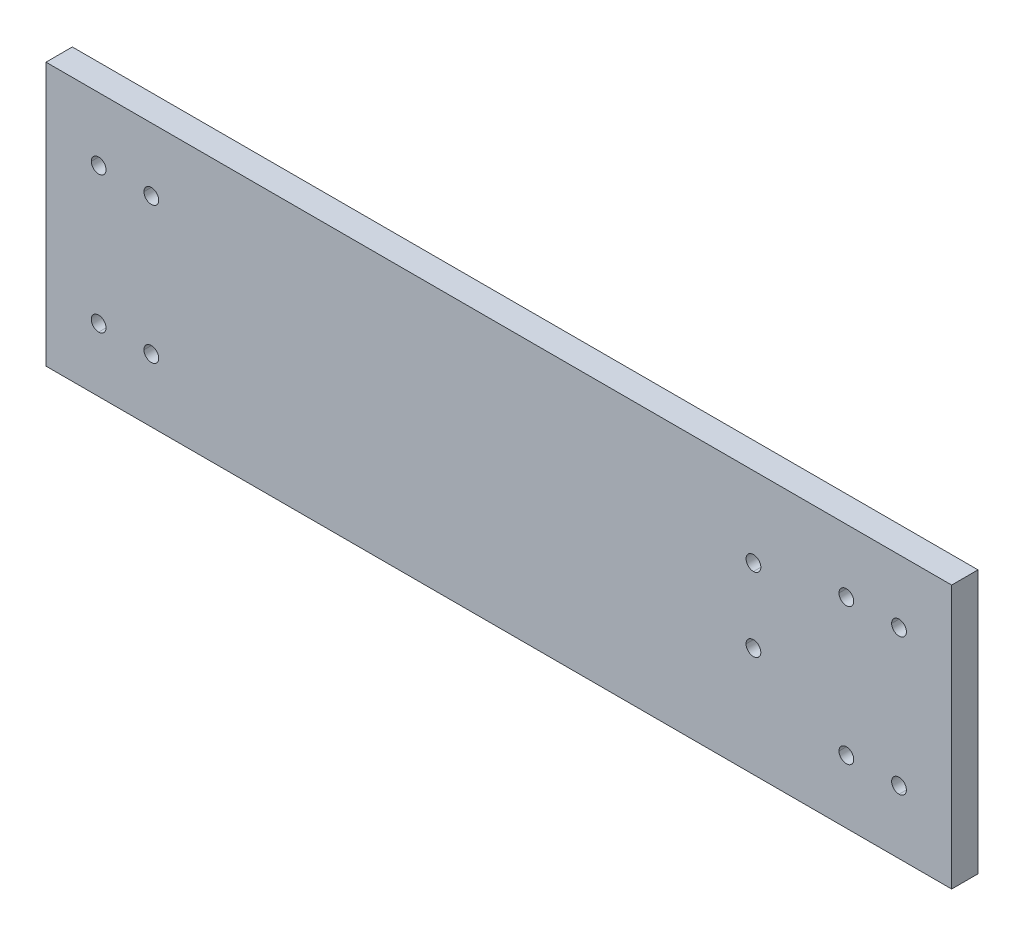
ISO-10303-21;
HEADER;
FILE_DESCRIPTION(('STEP AP214'),'2;1');
FILE_NAME('part.step','',(''),(''),'','','');
FILE_SCHEMA(('AUTOMOTIVE_DESIGN { 1 0 10303 214 1 1 1 1 }'));
ENDSEC;
DATA;
#1=APPLICATION_CONTEXT('core data for automotive mechanical design processes');
#2=APPLICATION_PROTOCOL_DEFINITION('international standard','automotive_design',2000,#1);
#3=PRODUCT_CONTEXT('',#1,'mechanical');
#4=PRODUCT('Part','Part','',(#3));
#5=PRODUCT_RELATED_PRODUCT_CATEGORY('part','',(#4));
#6=PRODUCT_DEFINITION_FORMATION('','',#4);
#7=PRODUCT_DEFINITION_CONTEXT('part definition',#1,'design');
#8=PRODUCT_DEFINITION('design','',#6,#7);
#9=PRODUCT_DEFINITION_SHAPE('','',#8);
#10=(LENGTH_UNIT() NAMED_UNIT(*) SI_UNIT(.MILLI.,.METRE.));
#11=(NAMED_UNIT(*) PLANE_ANGLE_UNIT() SI_UNIT($,.RADIAN.));
#12=(NAMED_UNIT(*) SI_UNIT($,.STERADIAN.) SOLID_ANGLE_UNIT());
#13=UNCERTAINTY_MEASURE_WITH_UNIT(LENGTH_MEASURE(1.E-05),#10,'distance_accuracy_value','');
#14=(GEOMETRIC_REPRESENTATION_CONTEXT(3) GLOBAL_UNCERTAINTY_ASSIGNED_CONTEXT((#13)) GLOBAL_UNIT_ASSIGNED_CONTEXT((#10,
#11,#12)) REPRESENTATION_CONTEXT('',''));
#15=CARTESIAN_POINT('',(0.,0.,0.));
#16=DIRECTION('',(0.,0.,1.));
#17=DIRECTION('',(1.,0.,0.));
#18=AXIS2_PLACEMENT_3D('',#15,#16,#17);
#19=CARTESIAN_POINT('',(-130.005125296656,-4949.99972815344,-456.450170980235));
#20=DIRECTION('',(0.,0.,-1.));
#21=DIRECTION('',(-1.,0.,0.));
#22=AXIS2_PLACEMENT_3D('',#19,#20,#21);
#23=PLANE('',#22);
#24=DIRECTION('',(0.999999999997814,-2.09112819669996E-06,0.));
#25=VECTOR('',#24,1.);
#26=CARTESIAN_POINT('',(729.994351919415,-5200.00152652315,-456.450170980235));
#27=LINE('',#26,#25);
#28=CARTESIAN_POINT('',(-130.005648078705,-5199.9997281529,-456.450170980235));
#29=VERTEX_POINT('',#28);
#30=CARTESIAN_POINT('',(729.994351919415,-5200.00152652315,-456.450170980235));
#31=VERTEX_POINT('',#30);
#32=EDGE_CURVE('E346',#29,#31,#27,.T.);
#33=ORIENTED_EDGE('',*,*,#32,.F.);
#34=DIRECTION('',(-2.09112819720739E-06,-0.999999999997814,0.));
#35=VECTOR('',#34,1.);
#36=CARTESIAN_POINT('',(-130.005648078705,-5199.9997281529,-456.450170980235));
#37=LINE('',#36,#35);
#38=CARTESIAN_POINT('',(-130.005125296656,-4949.99972815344,-456.450170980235));
#39=VERTEX_POINT('',#38);
#40=EDGE_CURVE('E343',#39,#29,#37,.T.);
#41=ORIENTED_EDGE('',*,*,#40,.F.);
#42=DIRECTION('',(-0.999999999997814,2.09112819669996E-06,0.));
#43=VECTOR('',#42,1.);
#44=CARTESIAN_POINT('',(-130.005125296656,-4949.99972815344,-456.450170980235));
#45=LINE('',#44,#43);
#46=CARTESIAN_POINT('',(729.994874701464,-4950.00152652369,-456.450170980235));
#47=VERTEX_POINT('',#46);
#48=EDGE_CURVE('E338',#47,#39,#45,.T.);
#49=ORIENTED_EDGE('',*,*,#48,.F.);
#50=DIRECTION('',(2.09112819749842E-06,0.999999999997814,0.));
#51=VECTOR('',#50,1.);
#52=CARTESIAN_POINT('',(729.994874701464,-4950.00152652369,-456.450170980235));
#53=LINE('',#52,#51);
#54=EDGE_CURVE('E332',#31,#47,#53,.T.);
#55=ORIENTED_EDGE('',*,*,#54,.F.);
#56=EDGE_LOOP('',(#33,#41,#49,#55));
#57=FACE_BOUND('',#56,.T.);
#58=CARTESIAN_POINT('',(541.754997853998,-5026.00053171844,-456.450170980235));
#59=DIRECTION('',(0.,0.,-1.));
#60=DIRECTION('',(-1.,0.,0.));
#61=AXIS2_PLACEMENT_3D('',#58,#59,#60);
#62=CIRCLE('',#61,7.);
#63=CARTESIAN_POINT('',(541.7549832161,-5033.00053171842,-456.450170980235));
#64=VERTEX_POINT('',#63);
#65=CARTESIAN_POINT('',(541.755012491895,-5019.00053171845,-456.450170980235));
#66=VERTEX_POINT('',#65);
#67=EDGE_CURVE('E242',#64,#66,#62,.F.);
#68=ORIENTED_EDGE('',*,*,#67,.T.);
#69=CARTESIAN_POINT('',(541.754997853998,-5026.00053171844,-456.450170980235));
#70=DIRECTION('',(0.,0.,-1.));
#71=DIRECTION('',(-1.,0.,0.));
#72=AXIS2_PLACEMENT_3D('',#69,#70,#71);
#73=CIRCLE('',#72,7.);
#74=EDGE_CURVE('E240',#66,#64,#73,.F.);
#75=ORIENTED_EDGE('',*,*,#74,.T.);
#76=EDGE_LOOP('',(#68,#75));
#77=FACE_BOUND('',#76,.T.);
#78=CARTESIAN_POINT('',(541.754997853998,-5096.00053171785,-456.450170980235));
#79=DIRECTION('',(0.,0.,-1.));
#80=DIRECTION('',(0.,1.,0.));
#81=AXIS2_PLACEMENT_3D('',#78,#79,#80);
#82=CIRCLE('',#81,7.);
#83=CARTESIAN_POINT('',(534.754997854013,-5096.00051707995,-456.450170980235));
#84=VERTEX_POINT('',#83);
#85=CARTESIAN_POINT('',(548.754997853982,-5096.00054635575,-456.450170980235));
#86=VERTEX_POINT('',#85);
#87=EDGE_CURVE('E236',#84,#86,#82,.F.);
#88=ORIENTED_EDGE('',*,*,#87,.T.);
#89=CARTESIAN_POINT('',(541.754997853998,-5096.00053171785,-456.450170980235));
#90=DIRECTION('',(0.,0.,-1.));
#91=DIRECTION('',(0.,1.,0.));
#92=AXIS2_PLACEMENT_3D('',#89,#90,#91);
#93=CIRCLE('',#92,7.);
#94=EDGE_CURVE('E234',#86,#84,#93,.F.);
#95=ORIENTED_EDGE('',*,*,#94,.T.);
#96=EDGE_LOOP('',(#88,#95));
#97=FACE_BOUND('',#96,.T.);
#98=CARTESIAN_POINT('',(-80.0055226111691,-5139.99983270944,-456.450170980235));
#99=DIRECTION('',(0.,0.,-1.));
#100=DIRECTION('',(-1.,0.,0.));
#101=AXIS2_PLACEMENT_3D('',#98,#99,#100);
#102=CIRCLE('',#101,7.);
#103=CARTESIAN_POINT('',(-80.0055079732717,-5132.99983270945,-456.450170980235));
#104=VERTEX_POINT('',#103);
#105=CARTESIAN_POINT('',(-80.0055372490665,-5146.99983270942,-456.450170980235));
#106=VERTEX_POINT('',#105);
#107=EDGE_CURVE('E230',#104,#106,#102,.F.);
#108=ORIENTED_EDGE('',*,*,#107,.T.);
#109=CARTESIAN_POINT('',(-80.0055226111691,-5139.99983270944,-456.450170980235));
#110=DIRECTION('',(0.,0.,-1.));
#111=DIRECTION('',(-1.,0.,0.));
#112=AXIS2_PLACEMENT_3D('',#109,#110,#111);
#113=CIRCLE('',#112,7.);
#114=EDGE_CURVE('E228',#106,#104,#113,.F.);
#115=ORIENTED_EDGE('',*,*,#114,.T.);
#116=EDGE_LOOP('',(#108,#115));
#117=FACE_BOUND('',#116,.T.);
#118=CARTESIAN_POINT('',(-30.005522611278,-5139.99993726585,-456.450170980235));
#119=DIRECTION('',(0.,0.,-1.));
#120=DIRECTION('',(0.,1.,0.));
#121=AXIS2_PLACEMENT_3D('',#118,#119,#120);
#122=CIRCLE('',#121,7.);
#123=CARTESIAN_POINT('',(-37.005522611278,-5139.99993726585,-456.450170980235));
#124=VERTEX_POINT('',#123);
#125=CARTESIAN_POINT('',(-23.005522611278,-5139.99993726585,-456.450170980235));
#126=VERTEX_POINT('',#125);
#127=EDGE_CURVE('E224',#124,#126,#122,.F.);
#128=ORIENTED_EDGE('',*,*,#127,.T.);
#129=CARTESIAN_POINT('',(-30.005522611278,-5139.99993726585,-456.450170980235));
#130=DIRECTION('',(0.,0.,-1.));
#131=DIRECTION('',(0.,1.,0.));
#132=AXIS2_PLACEMENT_3D('',#129,#130,#131);
#133=CIRCLE('',#132,7.);
#134=EDGE_CURVE('E222',#126,#124,#133,.F.);
#135=ORIENTED_EDGE('',*,*,#134,.T.);
#136=EDGE_LOOP('',(#128,#135));
#137=FACE_BOUND('',#136,.T.);
#138=CARTESIAN_POINT('',(-30.0052507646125,-5009.99993726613,-456.450170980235));
#139=DIRECTION('',(0.,0.,-1.));
#140=DIRECTION('',(0.,1.,0.));
#141=AXIS2_PLACEMENT_3D('',#138,#139,#140);
#142=CIRCLE('',#141,7.);
#143=CARTESIAN_POINT('',(-23.0052507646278,-5009.99995190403,-456.450170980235));
#144=VERTEX_POINT('',#143);
#145=CARTESIAN_POINT('',(-37.0052507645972,-5009.99992262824,-456.450170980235));
#146=VERTEX_POINT('',#145);
#147=EDGE_CURVE('E218',#144,#146,#142,.F.);
#148=ORIENTED_EDGE('',*,*,#147,.T.);
#149=CARTESIAN_POINT('',(-30.0052507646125,-5009.99993726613,-456.450170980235));
#150=DIRECTION('',(0.,0.,-1.));
#151=DIRECTION('',(0.,1.,0.));
#152=AXIS2_PLACEMENT_3D('',#149,#150,#151);
#153=CIRCLE('',#152,7.);
#154=EDGE_CURVE('E216',#146,#144,#153,.F.);
#155=ORIENTED_EDGE('',*,*,#154,.T.);
#156=EDGE_LOOP('',(#148,#155));
#157=FACE_BOUND('',#156,.T.);
#158=CARTESIAN_POINT('',(-80.0052507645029,-5009.99983270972,-456.450170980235));
#159=DIRECTION('',(0.,0.,-1.));
#160=DIRECTION('',(0.,1.,0.));
#161=AXIS2_PLACEMENT_3D('',#158,#159,#160);
#162=CIRCLE('',#161,7.);
#163=CARTESIAN_POINT('',(-87.0052507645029,-5009.99983270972,-456.450170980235));
#164=VERTEX_POINT('',#163);
#165=CARTESIAN_POINT('',(-73.0052507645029,-5009.99983270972,-456.450170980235));
#166=VERTEX_POINT('',#165);
#167=EDGE_CURVE('E212',#164,#166,#162,.F.);
#168=ORIENTED_EDGE('',*,*,#167,.T.);
#169=CARTESIAN_POINT('',(-80.0052507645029,-5009.99983270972,-456.450170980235));
#170=DIRECTION('',(0.,0.,-1.));
#171=DIRECTION('',(0.,1.,0.));
#172=AXIS2_PLACEMENT_3D('',#169,#170,#171);
#173=CIRCLE('',#172,7.);
#174=EDGE_CURVE('E210',#166,#164,#173,.F.);
#175=ORIENTED_EDGE('',*,*,#174,.T.);
#176=EDGE_LOOP('',(#168,#175));
#177=FACE_BOUND('',#176,.T.);
#178=CARTESIAN_POINT('',(679.994477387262,-5140.00142196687,-456.450170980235));
#179=DIRECTION('',(0.,0.,-1.));
#180=DIRECTION('',(-1.,0.,0.));
#181=AXIS2_PLACEMENT_3D('',#178,#179,#180);
#182=CIRCLE('',#181,7.);
#183=CARTESIAN_POINT('',(679.994462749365,-5147.00142196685,-456.450170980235));
#184=VERTEX_POINT('',#183);
#185=CARTESIAN_POINT('',(679.99449202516,-5133.00142196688,-456.450170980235));
#186=VERTEX_POINT('',#185);
#187=EDGE_CURVE('E206',#184,#186,#182,.F.);
#188=ORIENTED_EDGE('',*,*,#187,.T.);
#189=CARTESIAN_POINT('',(679.994477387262,-5140.00142196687,-456.450170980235));
#190=DIRECTION('',(0.,0.,-1.));
#191=DIRECTION('',(-1.,0.,0.));
#192=AXIS2_PLACEMENT_3D('',#189,#190,#191);
#193=CIRCLE('',#192,7.);
#194=EDGE_CURVE('E204',#186,#184,#193,.F.);
#195=ORIENTED_EDGE('',*,*,#194,.T.);
#196=EDGE_LOOP('',(#188,#195));
#197=FACE_BOUND('',#196,.T.);
#198=CARTESIAN_POINT('',(629.994477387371,-5140.00131741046,-456.450170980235));
#199=DIRECTION('',(0.,0.,-1.));
#200=DIRECTION('',(0.,1.,0.));
#201=AXIS2_PLACEMENT_3D('',#198,#199,#200);
#202=CIRCLE('',#201,7.);
#203=CARTESIAN_POINT('',(622.994477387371,-5140.00131741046,-456.450170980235));
#204=VERTEX_POINT('',#203);
#205=CARTESIAN_POINT('',(636.994477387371,-5140.00131741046,-456.450170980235));
#206=VERTEX_POINT('',#205);
#207=EDGE_CURVE('E200',#204,#206,#202,.F.);
#208=ORIENTED_EDGE('',*,*,#207,.T.);
#209=CARTESIAN_POINT('',(629.994477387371,-5140.00131741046,-456.450170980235));
#210=DIRECTION('',(0.,0.,-1.));
#211=DIRECTION('',(0.,1.,0.));
#212=AXIS2_PLACEMENT_3D('',#209,#210,#211);
#213=CIRCLE('',#212,7.);
#214=EDGE_CURVE('E198',#206,#204,#213,.F.);
#215=ORIENTED_EDGE('',*,*,#214,.T.);
#216=EDGE_LOOP('',(#208,#215));
#217=FACE_BOUND('',#216,.T.);
#218=CARTESIAN_POINT('',(629.994749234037,-5010.00131741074,-456.450170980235));
#219=DIRECTION('',(0.,0.,-1.));
#220=DIRECTION('',(0.,1.,0.));
#221=AXIS2_PLACEMENT_3D('',#218,#219,#220);
#222=CIRCLE('',#221,7.);
#223=CARTESIAN_POINT('',(636.994749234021,-5010.00133204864,-456.450170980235));
#224=VERTEX_POINT('',#223);
#225=CARTESIAN_POINT('',(622.994749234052,-5010.00130277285,-456.450170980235));
#226=VERTEX_POINT('',#225);
#227=EDGE_CURVE('E195',#224,#226,#222,.F.);
#228=ORIENTED_EDGE('',*,*,#227,.T.);
#229=CARTESIAN_POINT('',(629.994749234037,-5010.00131741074,-456.450170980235));
#230=DIRECTION('',(0.,0.,-1.));
#231=DIRECTION('',(0.,1.,0.));
#232=AXIS2_PLACEMENT_3D('',#229,#230,#231);
#233=CIRCLE('',#232,7.);
#234=EDGE_CURVE('E188',#226,#224,#233,.F.);
#235=ORIENTED_EDGE('',*,*,#234,.T.);
#236=EDGE_LOOP('',(#228,#235));
#237=FACE_BOUND('',#236,.T.);
#238=CARTESIAN_POINT('',(679.994749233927,-5010.00142196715,-456.450170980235));
#239=DIRECTION('',(0.,0.,-1.));
#240=DIRECTION('',(0.,1.,0.));
#241=AXIS2_PLACEMENT_3D('',#238,#239,#240);
#242=CIRCLE('',#241,7.);
#243=CARTESIAN_POINT('',(672.994749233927,-5010.00142196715,-456.450170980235));
#244=VERTEX_POINT('',#243);
#245=CARTESIAN_POINT('',(686.994749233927,-5010.00142196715,-456.450170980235));
#246=VERTEX_POINT('',#245);
#247=EDGE_CURVE('E175',#244,#246,#242,.F.);
#248=ORIENTED_EDGE('',*,*,#247,.T.);
#249=CARTESIAN_POINT('',(679.994749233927,-5010.00142196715,-456.450170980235));
#250=DIRECTION('',(0.,0.,-1.));
#251=DIRECTION('',(0.,1.,0.));
#252=AXIS2_PLACEMENT_3D('',#249,#250,#251);
#253=CIRCLE('',#252,7.);
#254=EDGE_CURVE('E20',#246,#244,#253,.F.);
#255=ORIENTED_EDGE('',*,*,#254,.T.);
#256=EDGE_LOOP('',(#248,#255));
#257=FACE_BOUND('',#256,.T.);
#258=ADVANCED_FACE('F17',(#57,#77,#97,#117,#137,#157,#177,#197,#217,#237,#257),#23,.T.);
#259=CARTESIAN_POINT('',(679.994749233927,-5010.00142196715,-443.950170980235));
#260=DIRECTION('',(0.,0.,-1.));
#261=DIRECTION('',(0.,1.,0.));
#262=AXIS2_PLACEMENT_3D('',#259,#260,#261);
#263=CYLINDRICAL_SURFACE('',#262,7.);
#264=ORIENTED_EDGE('',*,*,#254,.F.);
#265=DIRECTION('',(0.,0.,-1.));
#266=VECTOR('',#265,1.);
#267=CARTESIAN_POINT('',(686.994749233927,-5010.00142196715,-443.950170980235));
#268=LINE('',#267,#266);
#269=CARTESIAN_POINT('',(686.994749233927,-5010.00142196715,-431.450170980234));
#270=VERTEX_POINT('',#269);
#271=EDGE_CURVE('E189',#246,#270,#268,.F.);
#272=ORIENTED_EDGE('',*,*,#271,.T.);
#273=CARTESIAN_POINT('',(679.994749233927,-5010.00142196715,-431.450170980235));
#274=DIRECTION('',(0.,0.,-1.));
#275=DIRECTION('',(0.,1.,0.));
#276=AXIS2_PLACEMENT_3D('',#273,#274,#275);
#277=CIRCLE('',#276,7.);
#278=CARTESIAN_POINT('',(672.994749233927,-5010.00142196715,-431.450170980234));
#279=VERTEX_POINT('',#278);
#280=EDGE_CURVE('E184',#279,#270,#277,.T.);
#281=ORIENTED_EDGE('',*,*,#280,.F.);
#282=DIRECTION('',(0.,0.,-1.));
#283=VECTOR('',#282,1.);
#284=CARTESIAN_POINT('',(672.994749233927,-5010.00142196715,-443.950170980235));
#285=LINE('',#284,#283);
#286=EDGE_CURVE('E181',#279,#244,#285,.T.);
#287=ORIENTED_EDGE('',*,*,#286,.T.);
#288=EDGE_LOOP('',(#264,#272,#281,#287));
#289=FACE_BOUND('',#288,.T.);
#290=ADVANCED_FACE('F182',(#289),#263,.F.);
#291=CARTESIAN_POINT('',(679.994749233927,-5010.00142196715,-443.950170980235));
#292=DIRECTION('',(0.,0.,-1.));
#293=DIRECTION('',(0.,1.,0.));
#294=AXIS2_PLACEMENT_3D('',#291,#292,#293);
#295=CYLINDRICAL_SURFACE('',#294,7.);
#296=CARTESIAN_POINT('',(679.994749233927,-5010.00142196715,-431.450170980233));
#297=DIRECTION('',(0.,0.,-1.));
#298=DIRECTION('',(0.,1.,0.));
#299=AXIS2_PLACEMENT_3D('',#296,#297,#298);
#300=CIRCLE('',#299,7.);
#301=EDGE_CURVE('E247',#270,#279,#300,.T.);
#302=ORIENTED_EDGE('',*,*,#301,.F.);
#303=ORIENTED_EDGE('',*,*,#271,.F.);
#304=ORIENTED_EDGE('',*,*,#247,.F.);
#305=ORIENTED_EDGE('',*,*,#286,.F.);
#306=EDGE_LOOP('',(#302,#303,#304,#305));
#307=FACE_BOUND('',#306,.T.);
#308=ADVANCED_FACE('F191',(#307),#295,.F.);
#309=CARTESIAN_POINT('',(629.994749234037,-5010.00131741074,-443.950170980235));
#310=DIRECTION('',(0.,0.,-1.));
#311=DIRECTION('',(0.,1.,0.));
#312=AXIS2_PLACEMENT_3D('',#309,#310,#311);
#313=CYLINDRICAL_SURFACE('',#312,7.);
#314=ORIENTED_EDGE('',*,*,#234,.F.);
#315=DIRECTION('',(0.,0.,-1.));
#316=VECTOR('',#315,1.);
#317=CARTESIAN_POINT('',(622.994749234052,-5010.00130277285,-443.950170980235));
#318=LINE('',#317,#316);
#319=CARTESIAN_POINT('',(622.994749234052,-5010.00130277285,-431.450170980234));
#320=VERTEX_POINT('',#319);
#321=EDGE_CURVE('E197',#226,#320,#318,.F.);
#322=ORIENTED_EDGE('',*,*,#321,.T.);
#323=CARTESIAN_POINT('',(629.994749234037,-5010.00131741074,-431.450170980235));
#324=DIRECTION('',(0.,0.,-1.));
#325=DIRECTION('',(0.,1.,0.));
#326=AXIS2_PLACEMENT_3D('',#323,#324,#325);
#327=CIRCLE('',#326,7.);
#328=CARTESIAN_POINT('',(636.994749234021,-5010.00133204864,-431.450170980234));
#329=VERTEX_POINT('',#328);
#330=EDGE_CURVE('E250',#329,#320,#327,.T.);
#331=ORIENTED_EDGE('',*,*,#330,.F.);
#332=DIRECTION('',(0.,0.,-1.));
#333=VECTOR('',#332,1.);
#334=CARTESIAN_POINT('',(636.994749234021,-5010.00133204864,-443.950170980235));
#335=LINE('',#334,#333);
#336=EDGE_CURVE('E201',#329,#224,#335,.T.);
#337=ORIENTED_EDGE('',*,*,#336,.T.);
#338=EDGE_LOOP('',(#314,#322,#331,#337));
#339=FACE_BOUND('',#338,.T.);
#340=ADVANCED_FACE('F544',(#339),#313,.F.);
#341=CARTESIAN_POINT('',(629.994749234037,-5010.00131741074,-443.950170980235));
#342=DIRECTION('',(0.,0.,-1.));
#343=DIRECTION('',(0.,1.,0.));
#344=AXIS2_PLACEMENT_3D('',#341,#342,#343);
#345=CYLINDRICAL_SURFACE('',#344,7.);
#346=CARTESIAN_POINT('',(629.994749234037,-5010.00131741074,-431.450170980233));
#347=DIRECTION('',(0.,0.,-1.));
#348=DIRECTION('',(0.,1.,0.));
#349=AXIS2_PLACEMENT_3D('',#346,#347,#348);
#350=CIRCLE('',#349,7.);
#351=EDGE_CURVE('E253',#320,#329,#350,.T.);
#352=ORIENTED_EDGE('',*,*,#351,.F.);
#353=ORIENTED_EDGE('',*,*,#321,.F.);
#354=ORIENTED_EDGE('',*,*,#227,.F.);
#355=ORIENTED_EDGE('',*,*,#336,.F.);
#356=EDGE_LOOP('',(#352,#353,#354,#355));
#357=FACE_BOUND('',#356,.T.);
#358=ADVANCED_FACE('F536',(#357),#345,.F.);
#359=CARTESIAN_POINT('',(629.994477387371,-5140.00131741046,-443.950170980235));
#360=DIRECTION('',(0.,0.,-1.));
#361=DIRECTION('',(0.,1.,0.));
#362=AXIS2_PLACEMENT_3D('',#359,#360,#361);
#363=CYLINDRICAL_SURFACE('',#362,7.);
#364=ORIENTED_EDGE('',*,*,#214,.F.);
#365=DIRECTION('',(0.,0.,-1.));
#366=VECTOR('',#365,1.);
#367=CARTESIAN_POINT('',(636.994477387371,-5140.00131741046,-443.950170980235));
#368=LINE('',#367,#366);
#369=CARTESIAN_POINT('',(636.994477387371,-5140.00131741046,-431.450170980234));
#370=VERTEX_POINT('',#369);
#371=EDGE_CURVE('E203',#206,#370,#368,.F.);
#372=ORIENTED_EDGE('',*,*,#371,.T.);
#373=CARTESIAN_POINT('',(629.994477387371,-5140.00131741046,-431.450170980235));
#374=DIRECTION('',(0.,0.,-1.));
#375=DIRECTION('',(0.,1.,0.));
#376=AXIS2_PLACEMENT_3D('',#373,#374,#375);
#377=CIRCLE('',#376,7.);
#378=CARTESIAN_POINT('',(622.994477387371,-5140.00131741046,-431.450170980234));
#379=VERTEX_POINT('',#378);
#380=EDGE_CURVE('E256',#379,#370,#377,.T.);
#381=ORIENTED_EDGE('',*,*,#380,.F.);
#382=DIRECTION('',(0.,0.,-1.));
#383=VECTOR('',#382,1.);
#384=CARTESIAN_POINT('',(622.994477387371,-5140.00131741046,-443.950170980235));
#385=LINE('',#384,#383);
#386=EDGE_CURVE('E207',#379,#204,#385,.T.);
#387=ORIENTED_EDGE('',*,*,#386,.T.);
#388=EDGE_LOOP('',(#364,#372,#381,#387));
#389=FACE_BOUND('',#388,.T.);
#390=ADVANCED_FACE('F528',(#389),#363,.F.);
#391=CARTESIAN_POINT('',(629.994477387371,-5140.00131741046,-443.950170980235));
#392=DIRECTION('',(0.,0.,-1.));
#393=DIRECTION('',(0.,1.,0.));
#394=AXIS2_PLACEMENT_3D('',#391,#392,#393);
#395=CYLINDRICAL_SURFACE('',#394,7.);
#396=CARTESIAN_POINT('',(629.994477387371,-5140.00131741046,-431.450170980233));
#397=DIRECTION('',(0.,0.,-1.));
#398=DIRECTION('',(0.,1.,0.));
#399=AXIS2_PLACEMENT_3D('',#396,#397,#398);
#400=CIRCLE('',#399,7.);
#401=EDGE_CURVE('E259',#370,#379,#400,.T.);
#402=ORIENTED_EDGE('',*,*,#401,.F.);
#403=ORIENTED_EDGE('',*,*,#371,.F.);
#404=ORIENTED_EDGE('',*,*,#207,.F.);
#405=ORIENTED_EDGE('',*,*,#386,.F.);
#406=EDGE_LOOP('',(#402,#403,#404,#405));
#407=FACE_BOUND('',#406,.T.);
#408=ADVANCED_FACE('F520',(#407),#395,.F.);
#409=CARTESIAN_POINT('',(679.994477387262,-5140.00142196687,-443.950170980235));
#410=DIRECTION('',(0.,0.,-1.));
#411=DIRECTION('',(-1.,0.,0.));
#412=AXIS2_PLACEMENT_3D('',#409,#410,#411);
#413=CYLINDRICAL_SURFACE('',#412,7.);
#414=ORIENTED_EDGE('',*,*,#194,.F.);
#415=DIRECTION('',(0.,0.,-1.));
#416=VECTOR('',#415,1.);
#417=CARTESIAN_POINT('',(679.99449202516,-5133.00142196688,-443.950170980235));
#418=LINE('',#417,#416);
#419=CARTESIAN_POINT('',(679.99449202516,-5133.00142196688,-431.450170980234));
#420=VERTEX_POINT('',#419);
#421=EDGE_CURVE('E209',#186,#420,#418,.F.);
#422=ORIENTED_EDGE('',*,*,#421,.T.);
#423=CARTESIAN_POINT('',(679.994477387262,-5140.00142196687,-431.450170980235));
#424=DIRECTION('',(0.,0.,-1.));
#425=DIRECTION('',(-1.,0.,0.));
#426=AXIS2_PLACEMENT_3D('',#423,#424,#425);
#427=CIRCLE('',#426,7.);
#428=CARTESIAN_POINT('',(679.994462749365,-5147.00142196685,-431.450170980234));
#429=VERTEX_POINT('',#428);
#430=EDGE_CURVE('E262',#429,#420,#427,.T.);
#431=ORIENTED_EDGE('',*,*,#430,.F.);
#432=DIRECTION('',(0.,0.,-1.));
#433=VECTOR('',#432,1.);
#434=CARTESIAN_POINT('',(679.994462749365,-5147.00142196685,-443.950170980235));
#435=LINE('',#434,#433);
#436=EDGE_CURVE('E213',#429,#184,#435,.T.);
#437=ORIENTED_EDGE('',*,*,#436,.T.);
#438=EDGE_LOOP('',(#414,#422,#431,#437));
#439=FACE_BOUND('',#438,.T.);
#440=ADVANCED_FACE('F512',(#439),#413,.F.);
#441=CARTESIAN_POINT('',(679.994477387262,-5140.00142196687,-443.950170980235));
#442=DIRECTION('',(0.,0.,-1.));
#443=DIRECTION('',(-1.,0.,0.));
#444=AXIS2_PLACEMENT_3D('',#441,#442,#443);
#445=CYLINDRICAL_SURFACE('',#444,7.);
#446=CARTESIAN_POINT('',(679.994477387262,-5140.00142196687,-431.450170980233));
#447=DIRECTION('',(0.,0.,-1.));
#448=DIRECTION('',(-1.,0.,0.));
#449=AXIS2_PLACEMENT_3D('',#446,#447,#448);
#450=CIRCLE('',#449,7.);
#451=EDGE_CURVE('E265',#420,#429,#450,.T.);
#452=ORIENTED_EDGE('',*,*,#451,.F.);
#453=ORIENTED_EDGE('',*,*,#421,.F.);
#454=ORIENTED_EDGE('',*,*,#187,.F.);
#455=ORIENTED_EDGE('',*,*,#436,.F.);
#456=EDGE_LOOP('',(#452,#453,#454,#455));
#457=FACE_BOUND('',#456,.T.);
#458=ADVANCED_FACE('F504',(#457),#445,.F.);
#459=CARTESIAN_POINT('',(-80.0052507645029,-5009.99983270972,-443.950170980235));
#460=DIRECTION('',(0.,0.,-1.));
#461=DIRECTION('',(0.,1.,0.));
#462=AXIS2_PLACEMENT_3D('',#459,#460,#461);
#463=CYLINDRICAL_SURFACE('',#462,7.);
#464=ORIENTED_EDGE('',*,*,#174,.F.);
#465=DIRECTION('',(0.,0.,-1.));
#466=VECTOR('',#465,1.);
#467=CARTESIAN_POINT('',(-73.0052507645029,-5009.99983270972,-443.950170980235));
#468=LINE('',#467,#466);
#469=CARTESIAN_POINT('',(-73.0052507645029,-5009.99983270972,-431.450170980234));
#470=VERTEX_POINT('',#469);
#471=EDGE_CURVE('E215',#166,#470,#468,.F.);
#472=ORIENTED_EDGE('',*,*,#471,.T.);
#473=CARTESIAN_POINT('',(-80.0052507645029,-5009.99983270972,-431.450170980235));
#474=DIRECTION('',(0.,0.,-1.));
#475=DIRECTION('',(0.,1.,0.));
#476=AXIS2_PLACEMENT_3D('',#473,#474,#475);
#477=CIRCLE('',#476,7.);
#478=CARTESIAN_POINT('',(-87.0052507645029,-5009.99983270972,-431.450170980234));
#479=VERTEX_POINT('',#478);
#480=EDGE_CURVE('E268',#479,#470,#477,.T.);
#481=ORIENTED_EDGE('',*,*,#480,.F.);
#482=DIRECTION('',(0.,0.,-1.));
#483=VECTOR('',#482,1.);
#484=CARTESIAN_POINT('',(-87.0052507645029,-5009.99983270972,-443.950170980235));
#485=LINE('',#484,#483);
#486=EDGE_CURVE('E219',#479,#164,#485,.T.);
#487=ORIENTED_EDGE('',*,*,#486,.T.);
#488=EDGE_LOOP('',(#464,#472,#481,#487));
#489=FACE_BOUND('',#488,.T.);
#490=ADVANCED_FACE('F496',(#489),#463,.F.);
#491=CARTESIAN_POINT('',(-80.0052507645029,-5009.99983270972,-443.950170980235));
#492=DIRECTION('',(0.,0.,-1.));
#493=DIRECTION('',(0.,1.,0.));
#494=AXIS2_PLACEMENT_3D('',#491,#492,#493);
#495=CYLINDRICAL_SURFACE('',#494,7.);
#496=CARTESIAN_POINT('',(-80.0052507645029,-5009.99983270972,-431.450170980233));
#497=DIRECTION('',(0.,0.,-1.));
#498=DIRECTION('',(0.,1.,0.));
#499=AXIS2_PLACEMENT_3D('',#496,#497,#498);
#500=CIRCLE('',#499,7.);
#501=EDGE_CURVE('E271',#470,#479,#500,.T.);
#502=ORIENTED_EDGE('',*,*,#501,.F.);
#503=ORIENTED_EDGE('',*,*,#471,.F.);
#504=ORIENTED_EDGE('',*,*,#167,.F.);
#505=ORIENTED_EDGE('',*,*,#486,.F.);
#506=EDGE_LOOP('',(#502,#503,#504,#505));
#507=FACE_BOUND('',#506,.T.);
#508=ADVANCED_FACE('F488',(#507),#495,.F.);
#509=CARTESIAN_POINT('',(-30.0052507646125,-5009.99993726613,-443.950170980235));
#510=DIRECTION('',(0.,0.,-1.));
#511=DIRECTION('',(0.,1.,0.));
#512=AXIS2_PLACEMENT_3D('',#509,#510,#511);
#513=CYLINDRICAL_SURFACE('',#512,7.);
#514=ORIENTED_EDGE('',*,*,#154,.F.);
#515=DIRECTION('',(0.,0.,-1.));
#516=VECTOR('',#515,1.);
#517=CARTESIAN_POINT('',(-37.0052507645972,-5009.99992262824,-443.950170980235));
#518=LINE('',#517,#516);
#519=CARTESIAN_POINT('',(-37.0052507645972,-5009.99992262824,-431.450170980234));
#520=VERTEX_POINT('',#519);
#521=EDGE_CURVE('E221',#146,#520,#518,.F.);
#522=ORIENTED_EDGE('',*,*,#521,.T.);
#523=CARTESIAN_POINT('',(-30.0052507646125,-5009.99993726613,-431.450170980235));
#524=DIRECTION('',(0.,0.,-1.));
#525=DIRECTION('',(0.,1.,0.));
#526=AXIS2_PLACEMENT_3D('',#523,#524,#525);
#527=CIRCLE('',#526,7.);
#528=CARTESIAN_POINT('',(-23.0052507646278,-5009.99995190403,-431.450170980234));
#529=VERTEX_POINT('',#528);
#530=EDGE_CURVE('E274',#529,#520,#527,.T.);
#531=ORIENTED_EDGE('',*,*,#530,.F.);
#532=DIRECTION('',(0.,0.,-1.));
#533=VECTOR('',#532,1.);
#534=CARTESIAN_POINT('',(-23.0052507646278,-5009.99995190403,-443.950170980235));
#535=LINE('',#534,#533);
#536=EDGE_CURVE('E225',#529,#144,#535,.T.);
#537=ORIENTED_EDGE('',*,*,#536,.T.);
#538=EDGE_LOOP('',(#514,#522,#531,#537));
#539=FACE_BOUND('',#538,.T.);
#540=ADVANCED_FACE('F480',(#539),#513,.F.);
#541=CARTESIAN_POINT('',(-30.0052507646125,-5009.99993726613,-443.950170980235));
#542=DIRECTION('',(0.,0.,-1.));
#543=DIRECTION('',(0.,1.,0.));
#544=AXIS2_PLACEMENT_3D('',#541,#542,#543);
#545=CYLINDRICAL_SURFACE('',#544,7.);
#546=CARTESIAN_POINT('',(-30.0052507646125,-5009.99993726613,-431.450170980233));
#547=DIRECTION('',(0.,0.,-1.));
#548=DIRECTION('',(0.,1.,0.));
#549=AXIS2_PLACEMENT_3D('',#546,#547,#548);
#550=CIRCLE('',#549,7.);
#551=EDGE_CURVE('E277',#520,#529,#550,.T.);
#552=ORIENTED_EDGE('',*,*,#551,.F.);
#553=ORIENTED_EDGE('',*,*,#521,.F.);
#554=ORIENTED_EDGE('',*,*,#147,.F.);
#555=ORIENTED_EDGE('',*,*,#536,.F.);
#556=EDGE_LOOP('',(#552,#553,#554,#555));
#557=FACE_BOUND('',#556,.T.);
#558=ADVANCED_FACE('F472',(#557),#545,.F.);
#559=CARTESIAN_POINT('',(-30.005522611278,-5139.99993726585,-443.950170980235));
#560=DIRECTION('',(0.,0.,-1.));
#561=DIRECTION('',(0.,1.,0.));
#562=AXIS2_PLACEMENT_3D('',#559,#560,#561);
#563=CYLINDRICAL_SURFACE('',#562,7.);
#564=ORIENTED_EDGE('',*,*,#134,.F.);
#565=DIRECTION('',(0.,0.,-1.));
#566=VECTOR('',#565,1.);
#567=CARTESIAN_POINT('',(-23.005522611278,-5139.99993726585,-443.950170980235));
#568=LINE('',#567,#566);
#569=CARTESIAN_POINT('',(-23.005522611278,-5139.99993726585,-431.450170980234));
#570=VERTEX_POINT('',#569);
#571=EDGE_CURVE('E227',#126,#570,#568,.F.);
#572=ORIENTED_EDGE('',*,*,#571,.T.);
#573=CARTESIAN_POINT('',(-30.005522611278,-5139.99993726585,-431.450170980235));
#574=DIRECTION('',(0.,0.,-1.));
#575=DIRECTION('',(0.,1.,0.));
#576=AXIS2_PLACEMENT_3D('',#573,#574,#575);
#577=CIRCLE('',#576,7.);
#578=CARTESIAN_POINT('',(-37.005522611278,-5139.99993726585,-431.450170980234));
#579=VERTEX_POINT('',#578);
#580=EDGE_CURVE('E280',#579,#570,#577,.T.);
#581=ORIENTED_EDGE('',*,*,#580,.F.);
#582=DIRECTION('',(0.,0.,-1.));
#583=VECTOR('',#582,1.);
#584=CARTESIAN_POINT('',(-37.005522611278,-5139.99993726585,-443.950170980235));
#585=LINE('',#584,#583);
#586=EDGE_CURVE('E231',#579,#124,#585,.T.);
#587=ORIENTED_EDGE('',*,*,#586,.T.);
#588=EDGE_LOOP('',(#564,#572,#581,#587));
#589=FACE_BOUND('',#588,.T.);
#590=ADVANCED_FACE('F464',(#589),#563,.F.);
#591=CARTESIAN_POINT('',(-30.005522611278,-5139.99993726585,-443.950170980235));
#592=DIRECTION('',(0.,0.,-1.));
#593=DIRECTION('',(0.,1.,0.));
#594=AXIS2_PLACEMENT_3D('',#591,#592,#593);
#595=CYLINDRICAL_SURFACE('',#594,7.);
#596=CARTESIAN_POINT('',(-30.005522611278,-5139.99993726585,-431.450170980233));
#597=DIRECTION('',(0.,0.,-1.));
#598=DIRECTION('',(0.,1.,0.));
#599=AXIS2_PLACEMENT_3D('',#596,#597,#598);
#600=CIRCLE('',#599,7.);
#601=EDGE_CURVE('E283',#570,#579,#600,.T.);
#602=ORIENTED_EDGE('',*,*,#601,.F.);
#603=ORIENTED_EDGE('',*,*,#571,.F.);
#604=ORIENTED_EDGE('',*,*,#127,.F.);
#605=ORIENTED_EDGE('',*,*,#586,.F.);
#606=EDGE_LOOP('',(#602,#603,#604,#605));
#607=FACE_BOUND('',#606,.T.);
#608=ADVANCED_FACE('F456',(#607),#595,.F.);
#609=CARTESIAN_POINT('',(-80.0055226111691,-5139.99983270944,-443.950170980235));
#610=DIRECTION('',(0.,0.,-1.));
#611=DIRECTION('',(-1.,0.,0.));
#612=AXIS2_PLACEMENT_3D('',#609,#610,#611);
#613=CYLINDRICAL_SURFACE('',#612,7.);
#614=ORIENTED_EDGE('',*,*,#114,.F.);
#615=DIRECTION('',(0.,0.,-1.));
#616=VECTOR('',#615,1.);
#617=CARTESIAN_POINT('',(-80.0055372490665,-5146.99983270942,-443.950170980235));
#618=LINE('',#617,#616);
#619=CARTESIAN_POINT('',(-80.0055372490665,-5146.99983270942,-431.450170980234));
#620=VERTEX_POINT('',#619);
#621=EDGE_CURVE('E233',#106,#620,#618,.F.);
#622=ORIENTED_EDGE('',*,*,#621,.T.);
#623=CARTESIAN_POINT('',(-80.0055226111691,-5139.99983270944,-431.450170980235));
#624=DIRECTION('',(0.,0.,-1.));
#625=DIRECTION('',(-1.,0.,0.));
#626=AXIS2_PLACEMENT_3D('',#623,#624,#625);
#627=CIRCLE('',#626,7.);
#628=CARTESIAN_POINT('',(-80.0055079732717,-5132.99983270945,-431.450170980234));
#629=VERTEX_POINT('',#628);
#630=EDGE_CURVE('E286',#629,#620,#627,.T.);
#631=ORIENTED_EDGE('',*,*,#630,.F.);
#632=DIRECTION('',(0.,0.,-1.));
#633=VECTOR('',#632,1.);
#634=CARTESIAN_POINT('',(-80.0055079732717,-5132.99983270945,-443.950170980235));
#635=LINE('',#634,#633);
#636=EDGE_CURVE('E237',#629,#104,#635,.T.);
#637=ORIENTED_EDGE('',*,*,#636,.T.);
#638=EDGE_LOOP('',(#614,#622,#631,#637));
#639=FACE_BOUND('',#638,.T.);
#640=ADVANCED_FACE('F448',(#639),#613,.F.);
#641=CARTESIAN_POINT('',(-80.0055226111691,-5139.99983270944,-443.950170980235));
#642=DIRECTION('',(0.,0.,-1.));
#643=DIRECTION('',(-1.,0.,0.));
#644=AXIS2_PLACEMENT_3D('',#641,#642,#643);
#645=CYLINDRICAL_SURFACE('',#644,7.);
#646=CARTESIAN_POINT('',(-80.0055226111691,-5139.99983270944,-431.450170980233));
#647=DIRECTION('',(0.,0.,-1.));
#648=DIRECTION('',(-1.,0.,0.));
#649=AXIS2_PLACEMENT_3D('',#646,#647,#648);
#650=CIRCLE('',#649,7.);
#651=EDGE_CURVE('E289',#620,#629,#650,.T.);
#652=ORIENTED_EDGE('',*,*,#651,.F.);
#653=ORIENTED_EDGE('',*,*,#621,.F.);
#654=ORIENTED_EDGE('',*,*,#107,.F.);
#655=ORIENTED_EDGE('',*,*,#636,.F.);
#656=EDGE_LOOP('',(#652,#653,#654,#655));
#657=FACE_BOUND('',#656,.T.);
#658=ADVANCED_FACE('F440',(#657),#645,.F.);
#659=CARTESIAN_POINT('',(541.754997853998,-5096.00053171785,-443.950170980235));
#660=DIRECTION('',(0.,0.,-1.));
#661=DIRECTION('',(0.,1.,0.));
#662=AXIS2_PLACEMENT_3D('',#659,#660,#661);
#663=CYLINDRICAL_SURFACE('',#662,7.);
#664=ORIENTED_EDGE('',*,*,#94,.F.);
#665=DIRECTION('',(0.,0.,-1.));
#666=VECTOR('',#665,1.);
#667=CARTESIAN_POINT('',(548.754997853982,-5096.00054635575,-443.950170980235));
#668=LINE('',#667,#666);
#669=CARTESIAN_POINT('',(548.754997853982,-5096.00054635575,-431.450170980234));
#670=VERTEX_POINT('',#669);
#671=EDGE_CURVE('E239',#86,#670,#668,.F.);
#672=ORIENTED_EDGE('',*,*,#671,.T.);
#673=CARTESIAN_POINT('',(541.754997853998,-5096.00053171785,-431.450170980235));
#674=DIRECTION('',(0.,0.,-1.));
#675=DIRECTION('',(0.,1.,0.));
#676=AXIS2_PLACEMENT_3D('',#673,#674,#675);
#677=CIRCLE('',#676,7.);
#678=CARTESIAN_POINT('',(534.754997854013,-5096.00051707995,-431.450170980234));
#679=VERTEX_POINT('',#678);
#680=EDGE_CURVE('E292',#679,#670,#677,.T.);
#681=ORIENTED_EDGE('',*,*,#680,.F.);
#682=DIRECTION('',(0.,0.,-1.));
#683=VECTOR('',#682,1.);
#684=CARTESIAN_POINT('',(534.754997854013,-5096.00051707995,-443.950170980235));
#685=LINE('',#684,#683);
#686=EDGE_CURVE('E243',#679,#84,#685,.T.);
#687=ORIENTED_EDGE('',*,*,#686,.T.);
#688=EDGE_LOOP('',(#664,#672,#681,#687));
#689=FACE_BOUND('',#688,.T.);
#690=ADVANCED_FACE('F432',(#689),#663,.F.);
#691=CARTESIAN_POINT('',(541.754997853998,-5096.00053171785,-443.950170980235));
#692=DIRECTION('',(0.,0.,-1.));
#693=DIRECTION('',(0.,1.,0.));
#694=AXIS2_PLACEMENT_3D('',#691,#692,#693);
#695=CYLINDRICAL_SURFACE('',#694,7.);
#696=CARTESIAN_POINT('',(541.754997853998,-5096.00053171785,-431.450170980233));
#697=DIRECTION('',(0.,0.,-1.));
#698=DIRECTION('',(0.,1.,0.));
#699=AXIS2_PLACEMENT_3D('',#696,#697,#698);
#700=CIRCLE('',#699,7.);
#701=EDGE_CURVE('E295',#670,#679,#700,.T.);
#702=ORIENTED_EDGE('',*,*,#701,.F.);
#703=ORIENTED_EDGE('',*,*,#671,.F.);
#704=ORIENTED_EDGE('',*,*,#87,.F.);
#705=ORIENTED_EDGE('',*,*,#686,.F.);
#706=EDGE_LOOP('',(#702,#703,#704,#705));
#707=FACE_BOUND('',#706,.T.);
#708=ADVANCED_FACE('F424',(#707),#695,.F.);
#709=CARTESIAN_POINT('',(541.754997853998,-5026.00053171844,-443.950170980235));
#710=DIRECTION('',(0.,0.,-1.));
#711=DIRECTION('',(-1.,0.,0.));
#712=AXIS2_PLACEMENT_3D('',#709,#710,#711);
#713=CYLINDRICAL_SURFACE('',#712,7.);
#714=ORIENTED_EDGE('',*,*,#74,.F.);
#715=DIRECTION('',(0.,0.,-1.));
#716=VECTOR('',#715,1.);
#717=CARTESIAN_POINT('',(541.755012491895,-5019.00053171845,-443.950170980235));
#718=LINE('',#717,#716);
#719=CARTESIAN_POINT('',(541.755012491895,-5019.00053171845,-431.450170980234));
#720=VERTEX_POINT('',#719);
#721=EDGE_CURVE('E245',#66,#720,#718,.F.);
#722=ORIENTED_EDGE('',*,*,#721,.T.);
#723=CARTESIAN_POINT('',(541.754997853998,-5026.00053171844,-431.450170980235));
#724=DIRECTION('',(0.,0.,-1.));
#725=DIRECTION('',(-1.,0.,0.));
#726=AXIS2_PLACEMENT_3D('',#723,#724,#725);
#727=CIRCLE('',#726,7.);
#728=CARTESIAN_POINT('',(541.7549832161,-5033.00053171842,-431.450170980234));
#729=VERTEX_POINT('',#728);
#730=EDGE_CURVE('E298',#729,#720,#727,.T.);
#731=ORIENTED_EDGE('',*,*,#730,.F.);
#732=DIRECTION('',(0.,0.,-1.));
#733=VECTOR('',#732,1.);
#734=CARTESIAN_POINT('',(541.7549832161,-5033.00053171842,-443.950170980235));
#735=LINE('',#734,#733);
#736=EDGE_CURVE('E329',#729,#64,#735,.T.);
#737=ORIENTED_EDGE('',*,*,#736,.T.);
#738=EDGE_LOOP('',(#714,#722,#731,#737));
#739=FACE_BOUND('',#738,.T.);
#740=ADVANCED_FACE('F383',(#739),#713,.F.);
#741=CARTESIAN_POINT('',(541.754997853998,-5026.00053171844,-443.950170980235));
#742=DIRECTION('',(0.,0.,-1.));
#743=DIRECTION('',(-1.,0.,0.));
#744=AXIS2_PLACEMENT_3D('',#741,#742,#743);
#745=CYLINDRICAL_SURFACE('',#744,7.);
#746=CARTESIAN_POINT('',(541.754997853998,-5026.00053171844,-431.450170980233));
#747=DIRECTION('',(0.,0.,-1.));
#748=DIRECTION('',(-1.,0.,0.));
#749=AXIS2_PLACEMENT_3D('',#746,#747,#748);
#750=CIRCLE('',#749,7.);
#751=EDGE_CURVE('E301',#720,#729,#750,.T.);
#752=ORIENTED_EDGE('',*,*,#751,.F.);
#753=ORIENTED_EDGE('',*,*,#721,.F.);
#754=ORIENTED_EDGE('',*,*,#67,.F.);
#755=ORIENTED_EDGE('',*,*,#736,.F.);
#756=EDGE_LOOP('',(#752,#753,#754,#755));
#757=FACE_BOUND('',#756,.T.);
#758=ADVANCED_FACE('F375',(#757),#745,.F.);
#759=CARTESIAN_POINT('',(729.994874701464,-4950.00152652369,-431.450170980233));
#760=DIRECTION('',(0.999999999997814,-2.09112819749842E-06,0.));
#761=DIRECTION('',(2.09112819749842E-06,0.999999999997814,0.));
#762=AXIS2_PLACEMENT_3D('',#759,#760,#761);
#763=PLANE('',#762);
#764=ORIENTED_EDGE('',*,*,#54,.T.);
#765=DIRECTION('',(0.,0.,1.));
#766=VECTOR('',#765,1.);
#767=CARTESIAN_POINT('',(729.994874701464,-4950.00152652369,-431.450170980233));
#768=LINE('',#767,#766);
#769=CARTESIAN_POINT('',(729.994874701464,-4950.00152652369,-431.450170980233));
#770=VERTEX_POINT('',#769);
#771=EDGE_CURVE('E335',#770,#47,#768,.F.);
#772=ORIENTED_EDGE('',*,*,#771,.F.);
#773=DIRECTION('',(2.09112819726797E-06,0.999999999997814,0.));
#774=VECTOR('',#773,1.);
#775=CARTESIAN_POINT('',(729.994351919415,-5200.00152652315,-431.450170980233));
#776=LINE('',#775,#774);
#777=CARTESIAN_POINT('',(729.994351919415,-5200.00152652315,-431.450170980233));
#778=VERTEX_POINT('',#777);
#779=EDGE_CURVE('E303',#778,#770,#776,.T.);
#780=ORIENTED_EDGE('',*,*,#779,.F.);
#781=DIRECTION('',(0.,0.,1.));
#782=VECTOR('',#781,1.);
#783=CARTESIAN_POINT('',(729.994351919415,-5200.00152652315,-431.450170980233));
#784=LINE('',#783,#782);
#785=EDGE_CURVE('E248',#31,#778,#784,.T.);
#786=ORIENTED_EDGE('',*,*,#785,.F.);
#787=EDGE_LOOP('',(#764,#772,#780,#786));
#788=FACE_BOUND('',#787,.T.);
#789=ADVANCED_FACE('F373',(#788),#763,.T.);
#790=CARTESIAN_POINT('',(-130.005125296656,-4949.99972815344,-431.450170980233));
#791=DIRECTION('',(2.09112819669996E-06,0.999999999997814,0.));
#792=DIRECTION('',(-0.999999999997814,2.09112819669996E-06,0.));
#793=AXIS2_PLACEMENT_3D('',#790,#791,#792);
#794=PLANE('',#793);
#795=ORIENTED_EDGE('',*,*,#48,.T.);
#796=DIRECTION('',(0.,0.,1.));
#797=VECTOR('',#796,1.);
#798=CARTESIAN_POINT('',(-130.005125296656,-4949.99972815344,-431.450170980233));
#799=LINE('',#798,#797);
#800=CARTESIAN_POINT('',(-130.005125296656,-4949.99972815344,-431.450170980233));
#801=VERTEX_POINT('',#800);
#802=EDGE_CURVE('E340',#801,#39,#799,.F.);
#803=ORIENTED_EDGE('',*,*,#802,.F.);
#804=DIRECTION('',(-0.999999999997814,2.09112819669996E-06,0.));
#805=VECTOR('',#804,1.);
#806=CARTESIAN_POINT('',(729.994874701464,-4950.00152652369,-431.450170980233));
#807=LINE('',#806,#805);
#808=EDGE_CURVE('E353',#770,#801,#807,.T.);
#809=ORIENTED_EDGE('',*,*,#808,.F.);
#810=ORIENTED_EDGE('',*,*,#771,.T.);
#811=EDGE_LOOP('',(#795,#803,#809,#810));
#812=FACE_BOUND('',#811,.T.);
#813=ADVANCED_FACE('F365',(#812),#794,.T.);
#814=CARTESIAN_POINT('',(-130.005648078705,-5199.9997281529,-431.450170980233));
#815=DIRECTION('',(-0.999999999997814,2.09112819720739E-06,0.));
#816=DIRECTION('',(-2.09112819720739E-06,-0.999999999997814,0.));
#817=AXIS2_PLACEMENT_3D('',#814,#815,#816);
#818=PLANE('',#817);
#819=ORIENTED_EDGE('',*,*,#40,.T.);
#820=DIRECTION('',(0.,0.,1.));
#821=VECTOR('',#820,1.);
#822=CARTESIAN_POINT('',(-130.005648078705,-5199.9997281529,-431.450170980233));
#823=LINE('',#822,#821);
#824=CARTESIAN_POINT('',(-130.005648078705,-5199.9997281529,-431.450170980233));
#825=VERTEX_POINT('',#824);
#826=EDGE_CURVE('E35',#825,#29,#823,.F.);
#827=ORIENTED_EDGE('',*,*,#826,.F.);
#828=DIRECTION('',(-2.09112819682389E-06,-0.999999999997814,0.));
#829=VECTOR('',#828,1.);
#830=CARTESIAN_POINT('',(-130.005125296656,-4949.99972815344,-431.450170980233));
#831=LINE('',#830,#829);
#832=EDGE_CURVE('E26',#801,#825,#831,.T.);
#833=ORIENTED_EDGE('',*,*,#832,.F.);
#834=ORIENTED_EDGE('',*,*,#802,.T.);
#835=EDGE_LOOP('',(#819,#827,#833,#834));
#836=FACE_BOUND('',#835,.T.);
#837=ADVANCED_FACE('F361',(#836),#818,.T.);
#838=CARTESIAN_POINT('',(729.994351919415,-5200.00152652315,-431.450170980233));
#839=DIRECTION('',(-2.09112819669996E-06,-0.999999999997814,0.));
#840=DIRECTION('',(0.999999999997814,-2.09112819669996E-06,0.));
#841=AXIS2_PLACEMENT_3D('',#838,#839,#840);
#842=PLANE('',#841);
#843=ORIENTED_EDGE('',*,*,#32,.T.);
#844=ORIENTED_EDGE('',*,*,#785,.T.);
#845=DIRECTION('',(0.999999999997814,-2.09112819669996E-06,0.));
#846=VECTOR('',#845,1.);
#847=CARTESIAN_POINT('',(-130.005648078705,-5199.9997281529,-431.450170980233));
#848=LINE('',#847,#846);
#849=EDGE_CURVE('E11',#825,#778,#848,.T.);
#850=ORIENTED_EDGE('',*,*,#849,.F.);
#851=ORIENTED_EDGE('',*,*,#826,.T.);
#852=EDGE_LOOP('',(#843,#844,#850,#851));
#853=FACE_BOUND('',#852,.T.);
#854=ADVANCED_FACE('F371',(#853),#842,.T.);
#855=CARTESIAN_POINT('',(729.994351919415,-5200.00152652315,-431.450170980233));
#856=DIRECTION('',(0.,0.,1.));
#857=DIRECTION('',(0.,-1.,0.));
#858=AXIS2_PLACEMENT_3D('',#855,#856,#857);
#859=PLANE('',#858);
#860=ORIENTED_EDGE('',*,*,#832,.T.);
#861=ORIENTED_EDGE('',*,*,#849,.T.);
#862=ORIENTED_EDGE('',*,*,#779,.T.);
#863=ORIENTED_EDGE('',*,*,#808,.T.);
#864=EDGE_LOOP('',(#860,#861,#862,#863));
#865=FACE_BOUND('',#864,.T.);
#866=ORIENTED_EDGE('',*,*,#730,.T.);
#867=ORIENTED_EDGE('',*,*,#751,.T.);
#868=EDGE_LOOP('',(#866,#867));
#869=FACE_BOUND('',#868,.T.);
#870=ORIENTED_EDGE('',*,*,#680,.T.);
#871=ORIENTED_EDGE('',*,*,#701,.T.);
#872=EDGE_LOOP('',(#870,#871));
#873=FACE_BOUND('',#872,.T.);
#874=ORIENTED_EDGE('',*,*,#630,.T.);
#875=ORIENTED_EDGE('',*,*,#651,.T.);
#876=EDGE_LOOP('',(#874,#875));
#877=FACE_BOUND('',#876,.T.);
#878=ORIENTED_EDGE('',*,*,#580,.T.);
#879=ORIENTED_EDGE('',*,*,#601,.T.);
#880=EDGE_LOOP('',(#878,#879));
#881=FACE_BOUND('',#880,.T.);
#882=ORIENTED_EDGE('',*,*,#530,.T.);
#883=ORIENTED_EDGE('',*,*,#551,.T.);
#884=EDGE_LOOP('',(#882,#883));
#885=FACE_BOUND('',#884,.T.);
#886=ORIENTED_EDGE('',*,*,#480,.T.);
#887=ORIENTED_EDGE('',*,*,#501,.T.);
#888=EDGE_LOOP('',(#886,#887));
#889=FACE_BOUND('',#888,.T.);
#890=ORIENTED_EDGE('',*,*,#430,.T.);
#891=ORIENTED_EDGE('',*,*,#451,.T.);
#892=EDGE_LOOP('',(#890,#891));
#893=FACE_BOUND('',#892,.T.);
#894=ORIENTED_EDGE('',*,*,#380,.T.);
#895=ORIENTED_EDGE('',*,*,#401,.T.);
#896=EDGE_LOOP('',(#894,#895));
#897=FACE_BOUND('',#896,.T.);
#898=ORIENTED_EDGE('',*,*,#330,.T.);
#899=ORIENTED_EDGE('',*,*,#351,.T.);
#900=EDGE_LOOP('',(#898,#899));
#901=FACE_BOUND('',#900,.T.);
#902=ORIENTED_EDGE('',*,*,#280,.T.);
#903=ORIENTED_EDGE('',*,*,#301,.T.);
#904=EDGE_LOOP('',(#902,#903));
#905=FACE_BOUND('',#904,.T.);
#906=ADVANCED_FACE('F358',(#865,#869,#873,#877,#881,#885,#889,#893,#897,#901,#905),#859,.T.);
#907=CLOSED_SHELL('',(#258,#290,#308,#340,#358,#390,#408,#440,#458,#490,#508,#540,#558,#590,
#608,#640,#658,#690,#708,#740,#758,#789,#813,#837,#854,#906));
#908=MANIFOLD_SOLID_BREP('B1',#907);
#909=ADVANCED_BREP_SHAPE_REPRESENTATION('',(#18,#908),#14);
#910=SHAPE_DEFINITION_REPRESENTATION(#9,#909);
ENDSEC;
END-ISO-10303-21;
